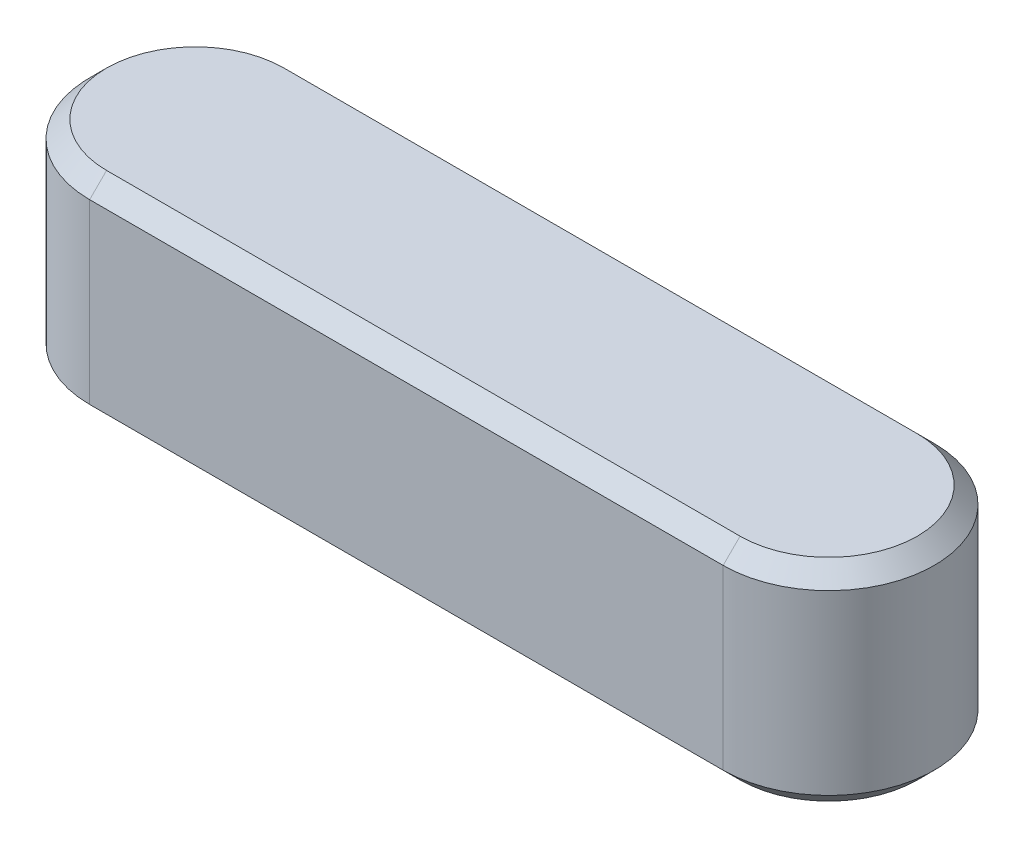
from build123d import *

# Parameters (mm, degrees)
BODYSKE_W      = 8
BODYSKE_H      = 2
BASEBODY_DEPTH = 2
FILLET1_RADIUS = 1
FILLET1_LENGTH = 2
FILLET2_RADIUS = 1
FILLET2_LENGTH = 2
CHAMFER5_SIZE  = 0.16


with BuildPart() as part:
    # BodySke → BaseBody (new body)
    with BuildSketch(Plane(origin=(0, 0, 0), x_dir=(1, 0, 0), z_dir=(0, 1, 0))):
        with Locations((4, 0)):
            Rectangle(BODYSKE_W, BODYSKE_H)
    extrude(amount=BASEBODY_DEPTH)

    # Fillet1: full round fillet: the end face becomes a half cylinder, R = half its width
    fillet1_face = Plane((0, 1, 0), x_dir=(0, 1, 0), z_dir=(-1, 0, 0))  # on the end face: x along it, z out of the body
    fillet1_slab = fillet1_face.offset(-FILLET1_RADIUS / 2) * Box(FILLET1_LENGTH, 2 * FILLET1_RADIUS, FILLET1_RADIUS, mode=Mode.PRIVATE)  # the body's end, R deep
    fillet1_round = Plane((1, 1, 0), x_dir=(-1, 0, 0), z_dir=(0, 1, 0)) * Cylinder(FILLET1_RADIUS, FILLET1_LENGTH, mode=Mode.PRIVATE)  # its axis R under the face
    add(fillet1_slab - fillet1_round, mode=Mode.SUBTRACT)

    # Fillet2: full round fillet: the end face becomes a half cylinder, R = half its width
    fillet2_face = Plane((8, 1, 0), x_dir=(0, 1, 0), z_dir=(1, 0, 0))  # on the end face: x along it, z out of the body
    fillet2_slab = fillet2_face.offset(-FILLET2_RADIUS / 2) * Box(FILLET2_LENGTH, 2 * FILLET2_RADIUS, FILLET2_RADIUS, mode=Mode.PRIVATE)  # the body's end, R deep
    fillet2_round = Plane((7, 1, 0), x_dir=(1, 0, 0), z_dir=(0, 1, 0)) * Cylinder(FILLET2_RADIUS, FILLET2_LENGTH, mode=Mode.PRIVATE)  # its axis R under the face
    add(fillet2_slab - fillet2_round, mode=Mode.SUBTRACT)

    # Chamfer5
    chamfer5_edges = [part.edges().sort_by_distance(p)[0] for p in [
        (4, 0, 1),
        (4, 2, 1),
        (0, 2, 0),
        (0, 0, 0),
        (4, 0, -1),
        (4, 2, -1),
        (8, 0, 0),
        (8, 2, 0),
    ]]
    chamfer(chamfer5_edges, length=CHAMFER5_SIZE)


solid = part.part
